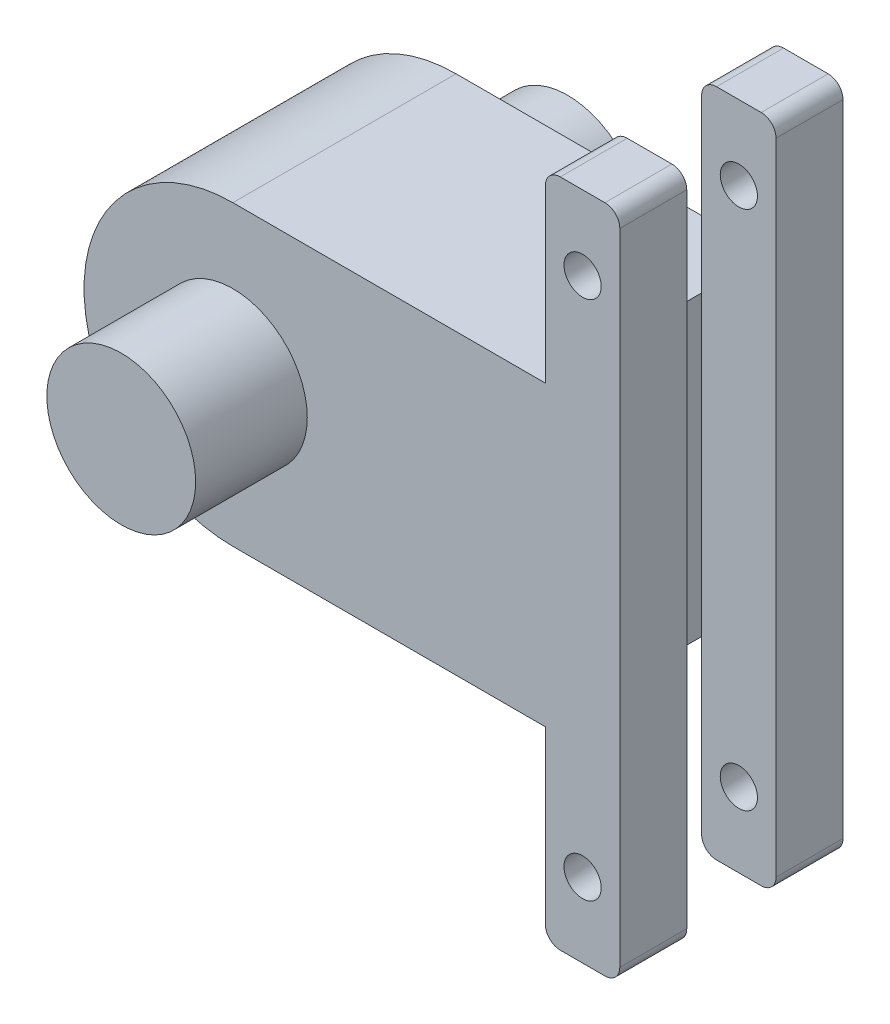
ISO-10303-21;
HEADER;
FILE_DESCRIPTION(('STEP AP214'),'2;1');
FILE_NAME('part.step','',(''),(''),'','','');
FILE_SCHEMA(('AUTOMOTIVE_DESIGN { 1 0 10303 214 1 1 1 1 }'));
ENDSEC;
DATA;
#1=APPLICATION_CONTEXT('core data for automotive mechanical design processes');
#2=APPLICATION_PROTOCOL_DEFINITION('international standard','automotive_design',2000,#1);
#3=PRODUCT_CONTEXT('',#1,'mechanical');
#4=PRODUCT('Part','Part','',(#3));
#5=PRODUCT_RELATED_PRODUCT_CATEGORY('part','',(#4));
#6=PRODUCT_DEFINITION_FORMATION('','',#4);
#7=PRODUCT_DEFINITION_CONTEXT('part definition',#1,'design');
#8=PRODUCT_DEFINITION('design','',#6,#7);
#9=PRODUCT_DEFINITION_SHAPE('','',#8);
#10=(LENGTH_UNIT() NAMED_UNIT(*) SI_UNIT(.MILLI.,.METRE.));
#11=(NAMED_UNIT(*) PLANE_ANGLE_UNIT() SI_UNIT($,.RADIAN.));
#12=(NAMED_UNIT(*) SI_UNIT($,.STERADIAN.) SOLID_ANGLE_UNIT());
#13=UNCERTAINTY_MEASURE_WITH_UNIT(LENGTH_MEASURE(1.E-05),#10,'distance_accuracy_value','');
#14=(GEOMETRIC_REPRESENTATION_CONTEXT(3) GLOBAL_UNCERTAINTY_ASSIGNED_CONTEXT((#13)) GLOBAL_UNIT_ASSIGNED_CONTEXT((#10,
#11,#12)) REPRESENTATION_CONTEXT('',''));
#15=CARTESIAN_POINT('',(0.,0.,0.));
#16=DIRECTION('',(0.,0.,1.));
#17=DIRECTION('',(1.,0.,0.));
#18=AXIS2_PLACEMENT_3D('',#15,#16,#17);
#19=CARTESIAN_POINT('',(0.,-45.,30.));
#20=DIRECTION('',(1.,0.,0.));
#21=DIRECTION('',(0.,1.,0.));
#22=AXIS2_PLACEMENT_3D('',#19,#20,#21);
#23=PLANE('',#22);
#24=DIRECTION('',(0.,-1.,0.));
#25=VECTOR('',#24,1.);
#26=CARTESIAN_POINT('',(0.,-45.,0.));
#27=LINE('',#26,#25);
#28=CARTESIAN_POINT('',(0.,-20.,0.));
#29=VERTEX_POINT('',#28);
#30=CARTESIAN_POINT('',(0.,-43.,0.));
#31=VERTEX_POINT('',#30);
#32=EDGE_CURVE('E269',#29,#31,#27,.T.);
#33=ORIENTED_EDGE('',*,*,#32,.T.);
#34=DIRECTION('',(0.,0.,-1.));
#35=VECTOR('',#34,1.);
#36=CARTESIAN_POINT('',(0.,-43.,30.));
#37=LINE('',#36,#35);
#38=CARTESIAN_POINT('',(0.,-43.,9.));
#39=VERTEX_POINT('',#38);
#40=EDGE_CURVE('E432',#31,#39,#37,.F.);
#41=ORIENTED_EDGE('',*,*,#40,.T.);
#42=DIRECTION('',(0.,-1.,0.));
#43=VECTOR('',#42,1.);
#44=CARTESIAN_POINT('',(0.,45.,9.));
#45=LINE('',#44,#43);
#46=CARTESIAN_POINT('',(0.,-20.,9.));
#47=VERTEX_POINT('',#46);
#48=EDGE_CURVE('E205',#47,#39,#45,.T.);
#49=ORIENTED_EDGE('',*,*,#48,.F.);
#50=DIRECTION('',(0.,0.,-1.));
#51=VECTOR('',#50,1.);
#52=CARTESIAN_POINT('',(0.,-20.,30.));
#53=LINE('',#52,#51);
#54=EDGE_CURVE('E232',#47,#29,#53,.T.);
#55=ORIENTED_EDGE('',*,*,#54,.T.);
#56=EDGE_LOOP('',(#33,#41,#49,#55));
#57=FACE_BOUND('',#56,.T.);
#58=ADVANCED_FACE('F43',(#57),#23,.F.);
#59=CARTESIAN_POINT('',(10.,-45.,30.));
#60=DIRECTION('',(0.,1.,0.));
#61=DIRECTION('',(0.,0.,1.));
#62=AXIS2_PLACEMENT_3D('',#59,#60,#61);
#63=PLANE('',#62);
#64=DIRECTION('',(1.,0.,0.));
#65=VECTOR('',#64,1.);
#66=CARTESIAN_POINT('',(10.,-45.,0.));
#67=LINE('',#66,#65);
#68=CARTESIAN_POINT('',(2.,-45.,0.));
#69=VERTEX_POINT('',#68);
#70=CARTESIAN_POINT('',(8.,-45.,0.));
#71=VERTEX_POINT('',#70);
#72=EDGE_CURVE('E265',#69,#71,#67,.T.);
#73=ORIENTED_EDGE('',*,*,#72,.T.);
#74=DIRECTION('',(0.,0.,-1.));
#75=VECTOR('',#74,1.);
#76=CARTESIAN_POINT('',(8.,-45.,30.));
#77=LINE('',#76,#75);
#78=CARTESIAN_POINT('',(8.,-45.,9.));
#79=VERTEX_POINT('',#78);
#80=EDGE_CURVE('E447',#71,#79,#77,.F.);
#81=ORIENTED_EDGE('',*,*,#80,.T.);
#82=DIRECTION('',(1.,0.,0.));
#83=VECTOR('',#82,1.);
#84=CARTESIAN_POINT('',(0.,-45.,9.));
#85=LINE('',#84,#83);
#86=CARTESIAN_POINT('',(2.,-45.,9.));
#87=VERTEX_POINT('',#86);
#88=EDGE_CURVE('E360',#87,#79,#85,.T.);
#89=ORIENTED_EDGE('',*,*,#88,.F.);
#90=DIRECTION('',(0.,0.,-1.));
#91=VECTOR('',#90,1.);
#92=CARTESIAN_POINT('',(2.,-45.,30.));
#93=LINE('',#92,#91);
#94=EDGE_CURVE('E450',#87,#69,#93,.T.);
#95=ORIENTED_EDGE('',*,*,#94,.T.);
#96=EDGE_LOOP('',(#73,#81,#89,#95));
#97=FACE_BOUND('',#96,.T.);
#98=ADVANCED_FACE('F510',(#97),#63,.F.);
#99=CARTESIAN_POINT('',(9.99999999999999,45.,30.));
#100=DIRECTION('',(-1.,0.,0.));
#101=DIRECTION('',(0.,-1.,0.));
#102=AXIS2_PLACEMENT_3D('',#99,#100,#101);
#103=PLANE('',#102);
#104=DIRECTION('',(0.,-1.,0.));
#105=VECTOR('',#104,1.);
#106=CARTESIAN_POINT('',(10.,45.,9.));
#107=LINE('',#106,#105);
#108=CARTESIAN_POINT('',(10.,43.,9.));
#109=VERTEX_POINT('',#108);
#110=CARTESIAN_POINT('',(10.,-43.,9.));
#111=VERTEX_POINT('',#110);
#112=EDGE_CURVE('E356',#109,#111,#107,.T.);
#113=ORIENTED_EDGE('',*,*,#112,.T.);
#114=DIRECTION('',(0.,0.,-1.));
#115=VECTOR('',#114,1.);
#116=CARTESIAN_POINT('',(10.,-43.,30.));
#117=LINE('',#116,#115);
#118=CARTESIAN_POINT('',(10.,-43.,0.));
#119=VERTEX_POINT('',#118);
#120=EDGE_CURVE('E466',#111,#119,#117,.T.);
#121=ORIENTED_EDGE('',*,*,#120,.T.);
#122=DIRECTION('',(0.,1.,0.));
#123=VECTOR('',#122,1.);
#124=CARTESIAN_POINT('',(9.99999999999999,45.,0.));
#125=LINE('',#124,#123);
#126=CARTESIAN_POINT('',(9.99999999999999,43.,0.));
#127=VERTEX_POINT('',#126);
#128=EDGE_CURVE('E261',#119,#127,#125,.T.);
#129=ORIENTED_EDGE('',*,*,#128,.T.);
#130=DIRECTION('',(0.,0.,-1.));
#131=VECTOR('',#130,1.);
#132=CARTESIAN_POINT('',(9.99999999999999,43.,30.));
#133=LINE('',#132,#131);
#134=EDGE_CURVE('E470',#127,#109,#133,.F.);
#135=ORIENTED_EDGE('',*,*,#134,.T.);
#136=EDGE_LOOP('',(#113,#121,#129,#135));
#137=FACE_BOUND('',#136,.T.);
#138=ADVANCED_FACE('F519',(#137),#103,.F.);
#139=CARTESIAN_POINT('',(0.,45.,30.));
#140=DIRECTION('',(0.,-1.,0.));
#141=DIRECTION('',(0.,0.,-1.));
#142=AXIS2_PLACEMENT_3D('',#139,#140,#141);
#143=PLANE('',#142);
#144=DIRECTION('',(-1.,0.,0.));
#145=VECTOR('',#144,1.);
#146=CARTESIAN_POINT('',(0.,45.,0.));
#147=LINE('',#146,#145);
#148=CARTESIAN_POINT('',(7.99999999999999,45.,0.));
#149=VERTEX_POINT('',#148);
#150=CARTESIAN_POINT('',(1.99999999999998,45.,0.));
#151=VERTEX_POINT('',#150);
#152=EDGE_CURVE('E257',#149,#151,#147,.T.);
#153=ORIENTED_EDGE('',*,*,#152,.T.);
#154=DIRECTION('',(0.,0.,-1.));
#155=VECTOR('',#154,1.);
#156=CARTESIAN_POINT('',(1.99999999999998,45.,30.));
#157=LINE('',#156,#155);
#158=CARTESIAN_POINT('',(1.99999999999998,45.,9.));
#159=VERTEX_POINT('',#158);
#160=EDGE_CURVE('E379',#151,#159,#157,.F.);
#161=ORIENTED_EDGE('',*,*,#160,.T.);
#162=DIRECTION('',(1.,0.,0.));
#163=VECTOR('',#162,1.);
#164=CARTESIAN_POINT('',(0.,45.,9.));
#165=LINE('',#164,#163);
#166=CARTESIAN_POINT('',(7.99999999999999,45.,9.));
#167=VERTEX_POINT('',#166);
#168=EDGE_CURVE('E351',#159,#167,#165,.T.);
#169=ORIENTED_EDGE('',*,*,#168,.T.);
#170=DIRECTION('',(0.,0.,-1.));
#171=VECTOR('',#170,1.);
#172=CARTESIAN_POINT('',(7.99999999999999,45.,30.));
#173=LINE('',#172,#171);
#174=EDGE_CURVE('E383',#167,#149,#173,.T.);
#175=ORIENTED_EDGE('',*,*,#174,.T.);
#176=EDGE_LOOP('',(#153,#161,#169,#175));
#177=FACE_BOUND('',#176,.T.);
#178=ADVANCED_FACE('F528',(#177),#143,.F.);
#179=CARTESIAN_POINT('',(0.,20.,30.));
#180=DIRECTION('',(1.,0.,0.));
#181=DIRECTION('',(0.,1.,0.));
#182=AXIS2_PLACEMENT_3D('',#179,#180,#181);
#183=PLANE('',#182);
#184=CARTESIAN_POINT('',(0.,43.,9.));
#185=VERTEX_POINT('',#184);
#186=CARTESIAN_POINT('',(0.,20.,9.));
#187=VERTEX_POINT('',#186);
#188=EDGE_CURVE('E353',#185,#187,#45,.T.);
#189=ORIENTED_EDGE('',*,*,#188,.F.);
#190=DIRECTION('',(0.,0.,-1.));
#191=VECTOR('',#190,1.);
#192=CARTESIAN_POINT('',(0.,43.,30.));
#193=LINE('',#192,#191);
#194=CARTESIAN_POINT('',(0.,43.,0.));
#195=VERTEX_POINT('',#194);
#196=EDGE_CURVE('E389',#185,#195,#193,.T.);
#197=ORIENTED_EDGE('',*,*,#196,.T.);
#198=DIRECTION('',(0.,-1.,0.));
#199=VECTOR('',#198,1.);
#200=CARTESIAN_POINT('',(0.,20.,0.));
#201=LINE('',#200,#199);
#202=CARTESIAN_POINT('',(0.,20.,0.));
#203=VERTEX_POINT('',#202);
#204=EDGE_CURVE('E254',#195,#203,#201,.T.);
#205=ORIENTED_EDGE('',*,*,#204,.T.);
#206=DIRECTION('',(0.,0.,-1.));
#207=VECTOR('',#206,1.);
#208=CARTESIAN_POINT('',(0.,20.,30.));
#209=LINE('',#208,#207);
#210=EDGE_CURVE('E222',#187,#203,#209,.T.);
#211=ORIENTED_EDGE('',*,*,#210,.F.);
#212=EDGE_LOOP('',(#189,#197,#205,#211));
#213=FACE_BOUND('',#212,.T.);
#214=ADVANCED_FACE('F535',(#213),#183,.F.);
#215=CARTESIAN_POINT('',(4.99999999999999,35.,30.));
#216=DIRECTION('',(0.,0.,-1.));
#217=DIRECTION('',(-1.,0.,0.));
#218=AXIS2_PLACEMENT_3D('',#215,#216,#217);
#219=CYLINDRICAL_SURFACE('',#218,2.5);
#220=CARTESIAN_POINT('',(4.99999999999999,35.,9.));
#221=DIRECTION('',(0.,0.,-1.));
#222=DIRECTION('',(-1.,0.,0.));
#223=AXIS2_PLACEMENT_3D('',#220,#221,#222);
#224=CIRCLE('',#223,2.5);
#225=CARTESIAN_POINT('',(2.49999999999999,35.,9.));
#226=VERTEX_POINT('',#225);
#227=EDGE_CURVE('E338',#226,#226,#224,.T.);
#228=ORIENTED_EDGE('',*,*,#227,.F.);
#229=EDGE_LOOP('',(#228));
#230=FACE_BOUND('',#229,.T.);
#231=CARTESIAN_POINT('',(4.99999999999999,35.,0.));
#232=DIRECTION('',(0.,0.,1.));
#233=DIRECTION('',(1.,0.,0.));
#234=AXIS2_PLACEMENT_3D('',#231,#232,#233);
#235=CIRCLE('',#234,2.5);
#236=CARTESIAN_POINT('',(7.49999999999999,35.,0.));
#237=VERTEX_POINT('',#236);
#238=EDGE_CURVE('E304',#237,#237,#235,.T.);
#239=ORIENTED_EDGE('',*,*,#238,.F.);
#240=EDGE_LOOP('',(#239));
#241=FACE_BOUND('',#240,.T.);
#242=ADVANCED_FACE('F716',(#230,#241),#219,.F.);
#243=CARTESIAN_POINT('',(4.99999999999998,-35.,30.));
#244=DIRECTION('',(0.,0.,-1.));
#245=DIRECTION('',(-1.,0.,0.));
#246=AXIS2_PLACEMENT_3D('',#243,#244,#245);
#247=CYLINDRICAL_SURFACE('',#246,2.5);
#248=CARTESIAN_POINT('',(4.99999999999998,-35.,9.));
#249=DIRECTION('',(0.,0.,-1.));
#250=DIRECTION('',(-1.,0.,0.));
#251=AXIS2_PLACEMENT_3D('',#248,#249,#250);
#252=CIRCLE('',#251,2.5);
#253=CARTESIAN_POINT('',(2.49999999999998,-35.,9.));
#254=VERTEX_POINT('',#253);
#255=EDGE_CURVE('E342',#254,#254,#252,.T.);
#256=ORIENTED_EDGE('',*,*,#255,.F.);
#257=EDGE_LOOP('',(#256));
#258=FACE_BOUND('',#257,.T.);
#259=CARTESIAN_POINT('',(4.99999999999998,-35.,0.));
#260=DIRECTION('',(0.,0.,1.));
#261=DIRECTION('',(-1.,0.,0.));
#262=AXIS2_PLACEMENT_3D('',#259,#260,#261);
#263=CIRCLE('',#262,2.5);
#264=CARTESIAN_POINT('',(2.49999999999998,-35.,0.));
#265=VERTEX_POINT('',#264);
#266=EDGE_CURVE('E312',#265,#265,#263,.T.);
#267=ORIENTED_EDGE('',*,*,#266,.F.);
#268=EDGE_LOOP('',(#267));
#269=FACE_BOUND('',#268,.T.);
#270=ADVANCED_FACE('F727',(#258,#269),#247,.F.);
#271=CARTESIAN_POINT('',(-42.,0.,30.));
#272=DIRECTION('',(0.,0.,1.));
#273=DIRECTION('',(1.,0.,0.));
#274=AXIS2_PLACEMENT_3D('',#271,#272,#273);
#275=PLANE('',#274);
#276=CARTESIAN_POINT('',(-42.,0.,30.));
#277=DIRECTION('',(0.,0.,1.));
#278=DIRECTION('',(1.,0.,0.));
#279=AXIS2_PLACEMENT_3D('',#276,#277,#278);
#280=CIRCLE('',#279,10.);
#281=CARTESIAN_POINT('',(-32.,0.,30.));
#282=VERTEX_POINT('',#281);
#283=EDGE_CURVE('E320',#282,#282,#280,.T.);
#284=ORIENTED_EDGE('',*,*,#283,.F.);
#285=EDGE_LOOP('',(#284));
#286=FACE_BOUND('',#285,.T.);
#287=CARTESIAN_POINT('',(4.99999999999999,35.,30.));
#288=DIRECTION('',(0.,0.,1.));
#289=DIRECTION('',(1.,0.,0.));
#290=AXIS2_PLACEMENT_3D('',#287,#288,#289);
#291=CIRCLE('',#290,2.5);
#292=CARTESIAN_POINT('',(7.49999999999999,35.,30.));
#293=VERTEX_POINT('',#292);
#294=EDGE_CURVE('E279',#293,#293,#291,.T.);
#295=ORIENTED_EDGE('',*,*,#294,.F.);
#296=EDGE_LOOP('',(#295));
#297=FACE_BOUND('',#296,.T.);
#298=DIRECTION('',(0.,-1.,0.));
#299=VECTOR('',#298,1.);
#300=CARTESIAN_POINT('',(0.,-45.,30.));
#301=LINE('',#300,#299);
#302=CARTESIAN_POINT('',(0.,-20.,30.));
#303=VERTEX_POINT('',#302);
#304=CARTESIAN_POINT('',(0.,-43.,30.));
#305=VERTEX_POINT('',#304);
#306=EDGE_CURVE('E294',#303,#305,#301,.T.);
#307=ORIENTED_EDGE('',*,*,#306,.T.);
#308=CARTESIAN_POINT('',(2.,-43.,30.));
#309=DIRECTION('',(0.,0.,1.));
#310=DIRECTION('',(1.,0.,0.));
#311=AXIS2_PLACEMENT_3D('',#308,#309,#310);
#312=CIRCLE('',#311,2.);
#313=CARTESIAN_POINT('',(2.,-45.,30.));
#314=VERTEX_POINT('',#313);
#315=EDGE_CURVE('E400',#305,#314,#312,.T.);
#316=ORIENTED_EDGE('',*,*,#315,.T.);
#317=DIRECTION('',(1.,0.,0.));
#318=VECTOR('',#317,1.);
#319=CARTESIAN_POINT('',(10.,-45.,30.));
#320=LINE('',#319,#318);
#321=CARTESIAN_POINT('',(8.,-45.,30.));
#322=VERTEX_POINT('',#321);
#323=EDGE_CURVE('E290',#314,#322,#320,.T.);
#324=ORIENTED_EDGE('',*,*,#323,.T.);
#325=CARTESIAN_POINT('',(8.,-43.,30.));
#326=DIRECTION('',(0.,0.,1.));
#327=DIRECTION('',(1.,0.,0.));
#328=AXIS2_PLACEMENT_3D('',#325,#326,#327);
#329=CIRCLE('',#328,2.);
#330=CARTESIAN_POINT('',(10.,-43.,30.));
#331=VERTEX_POINT('',#330);
#332=EDGE_CURVE('E403',#322,#331,#329,.T.);
#333=ORIENTED_EDGE('',*,*,#332,.T.);
#334=DIRECTION('',(0.,1.,0.));
#335=VECTOR('',#334,1.);
#336=CARTESIAN_POINT('',(9.99999999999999,45.,30.));
#337=LINE('',#336,#335);
#338=CARTESIAN_POINT('',(9.99999999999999,43.,30.));
#339=VERTEX_POINT('',#338);
#340=EDGE_CURVE('E286',#331,#339,#337,.T.);
#341=ORIENTED_EDGE('',*,*,#340,.T.);
#342=CARTESIAN_POINT('',(7.99999999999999,43.,30.));
#343=DIRECTION('',(0.,0.,1.));
#344=DIRECTION('',(1.,0.,0.));
#345=AXIS2_PLACEMENT_3D('',#342,#343,#344);
#346=CIRCLE('',#345,2.);
#347=CARTESIAN_POINT('',(7.99999999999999,45.,30.));
#348=VERTEX_POINT('',#347);
#349=EDGE_CURVE('E406',#339,#348,#346,.T.);
#350=ORIENTED_EDGE('',*,*,#349,.T.);
#351=DIRECTION('',(-1.,0.,0.));
#352=VECTOR('',#351,1.);
#353=CARTESIAN_POINT('',(0.,45.,30.));
#354=LINE('',#353,#352);
#355=CARTESIAN_POINT('',(1.99999999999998,45.,30.));
#356=VERTEX_POINT('',#355);
#357=EDGE_CURVE('E283',#348,#356,#354,.T.);
#358=ORIENTED_EDGE('',*,*,#357,.T.);
#359=CARTESIAN_POINT('',(1.99999999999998,43.,30.));
#360=DIRECTION('',(0.,0.,1.));
#361=DIRECTION('',(1.,0.,0.));
#362=AXIS2_PLACEMENT_3D('',#359,#360,#361);
#363=CIRCLE('',#362,2.);
#364=CARTESIAN_POINT('',(0.,43.,30.));
#365=VERTEX_POINT('',#364);
#366=EDGE_CURVE('E59',#356,#365,#363,.T.);
#367=ORIENTED_EDGE('',*,*,#366,.T.);
#368=DIRECTION('',(0.,-1.,0.));
#369=VECTOR('',#368,1.);
#370=CARTESIAN_POINT('',(0.,20.,30.));
#371=LINE('',#370,#369);
#372=CARTESIAN_POINT('',(0.,20.,30.));
#373=VERTEX_POINT('',#372);
#374=EDGE_CURVE('E247',#365,#373,#371,.T.);
#375=ORIENTED_EDGE('',*,*,#374,.T.);
#376=DIRECTION('',(-1.,0.,0.));
#377=VECTOR('',#376,1.);
#378=CARTESIAN_POINT('',(-42.,20.,30.));
#379=LINE('',#378,#377);
#380=CARTESIAN_POINT('',(-42.,20.,30.));
#381=VERTEX_POINT('',#380);
#382=EDGE_CURVE('E230',#373,#381,#379,.T.);
#383=ORIENTED_EDGE('',*,*,#382,.T.);
#384=CARTESIAN_POINT('',(-42.,0.,30.));
#385=DIRECTION('',(0.,0.,1.));
#386=DIRECTION('',(1.,0.,0.));
#387=AXIS2_PLACEMENT_3D('',#384,#385,#386);
#388=CIRCLE('',#387,20.);
#389=CARTESIAN_POINT('',(-42.,-20.,30.));
#390=VERTEX_POINT('',#389);
#391=EDGE_CURVE('E253',#381,#390,#388,.T.);
#392=ORIENTED_EDGE('',*,*,#391,.T.);
#393=DIRECTION('',(1.,0.,0.));
#394=VECTOR('',#393,1.);
#395=CARTESIAN_POINT('',(-42.,-20.,30.));
#396=LINE('',#395,#394);
#397=EDGE_CURVE('E298',#390,#303,#396,.T.);
#398=ORIENTED_EDGE('',*,*,#397,.T.);
#399=EDGE_LOOP('',(#307,#316,#324,#333,#341,#350,#358,#367,#375,#383,#392,#398));
#400=FACE_BOUND('',#399,.T.);
#401=CARTESIAN_POINT('',(4.99999999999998,-35.,30.));
#402=DIRECTION('',(0.,0.,1.));
#403=DIRECTION('',(-1.,0.,0.));
#404=AXIS2_PLACEMENT_3D('',#401,#402,#403);
#405=CIRCLE('',#404,2.5);
#406=CARTESIAN_POINT('',(2.49999999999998,-35.,30.));
#407=VERTEX_POINT('',#406);
#408=EDGE_CURVE('E308',#407,#407,#405,.T.);
#409=ORIENTED_EDGE('',*,*,#408,.F.);
#410=EDGE_LOOP('',(#409));
#411=FACE_BOUND('',#410,.T.);
#412=ADVANCED_FACE('F542',(#286,#297,#400,#411),#275,.T.);
#413=CARTESIAN_POINT('',(-42.,0.,0.));
#414=DIRECTION('',(0.,0.,1.));
#415=DIRECTION('',(1.,0.,0.));
#416=AXIS2_PLACEMENT_3D('',#413,#414,#415);
#417=PLANE('',#416);
#418=CARTESIAN_POINT('',(-42.,0.,0.));
#419=DIRECTION('',(0.,0.,1.));
#420=DIRECTION('',(1.,0.,0.));
#421=AXIS2_PLACEMENT_3D('',#418,#419,#420);
#422=CIRCLE('',#421,10.);
#423=CARTESIAN_POINT('',(-32.,0.,0.));
#424=VERTEX_POINT('',#423);
#425=EDGE_CURVE('E328',#424,#424,#422,.T.);
#426=ORIENTED_EDGE('',*,*,#425,.T.);
#427=EDGE_LOOP('',(#426));
#428=FACE_BOUND('',#427,.T.);
#429=ORIENTED_EDGE('',*,*,#128,.F.);
#430=CARTESIAN_POINT('',(8.,-43.,0.));
#431=DIRECTION('',(0.,0.,1.));
#432=DIRECTION('',(1.,0.,0.));
#433=AXIS2_PLACEMENT_3D('',#430,#431,#432);
#434=CIRCLE('',#433,2.);
#435=EDGE_CURVE('E454',#119,#71,#434,.F.);
#436=ORIENTED_EDGE('',*,*,#435,.T.);
#437=ORIENTED_EDGE('',*,*,#72,.F.);
#438=CARTESIAN_POINT('',(2.,-43.,0.));
#439=DIRECTION('',(0.,0.,1.));
#440=DIRECTION('',(1.,0.,0.));
#441=AXIS2_PLACEMENT_3D('',#438,#439,#440);
#442=CIRCLE('',#441,2.);
#443=EDGE_CURVE('E457',#69,#31,#442,.F.);
#444=ORIENTED_EDGE('',*,*,#443,.T.);
#445=ORIENTED_EDGE('',*,*,#32,.F.);
#446=DIRECTION('',(1.,0.,0.));
#447=VECTOR('',#446,1.);
#448=CARTESIAN_POINT('',(-42.,-20.,0.));
#449=LINE('',#448,#447);
#450=CARTESIAN_POINT('',(-42.,-20.,0.));
#451=VERTEX_POINT('',#450);
#452=EDGE_CURVE('E273',#451,#29,#449,.T.);
#453=ORIENTED_EDGE('',*,*,#452,.F.);
#454=CARTESIAN_POINT('',(-42.,0.,0.));
#455=DIRECTION('',(0.,0.,1.));
#456=DIRECTION('',(1.,0.,0.));
#457=AXIS2_PLACEMENT_3D('',#454,#455,#456);
#458=CIRCLE('',#457,20.);
#459=CARTESIAN_POINT('',(-42.,20.,0.));
#460=VERTEX_POINT('',#459);
#461=EDGE_CURVE('E277',#460,#451,#458,.T.);
#462=ORIENTED_EDGE('',*,*,#461,.F.);
#463=DIRECTION('',(-1.,0.,0.));
#464=VECTOR('',#463,1.);
#465=CARTESIAN_POINT('',(-42.,20.,0.));
#466=LINE('',#465,#464);
#467=EDGE_CURVE('E250',#203,#460,#466,.T.);
#468=ORIENTED_EDGE('',*,*,#467,.F.);
#469=ORIENTED_EDGE('',*,*,#204,.F.);
#470=CARTESIAN_POINT('',(1.99999999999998,43.,0.));
#471=DIRECTION('',(0.,0.,1.));
#472=DIRECTION('',(1.,0.,0.));
#473=AXIS2_PLACEMENT_3D('',#470,#471,#472);
#474=CIRCLE('',#473,2.);
#475=EDGE_CURVE('E460',#195,#151,#474,.F.);
#476=ORIENTED_EDGE('',*,*,#475,.T.);
#477=ORIENTED_EDGE('',*,*,#152,.F.);
#478=CARTESIAN_POINT('',(7.99999999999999,43.,0.));
#479=DIRECTION('',(0.,0.,1.));
#480=DIRECTION('',(1.,0.,0.));
#481=AXIS2_PLACEMENT_3D('',#478,#479,#480);
#482=CIRCLE('',#481,2.);
#483=EDGE_CURVE('E463',#149,#127,#482,.F.);
#484=ORIENTED_EDGE('',*,*,#483,.T.);
#485=EDGE_LOOP('',(#429,#436,#437,#444,#445,#453,#462,#468,#469,#476,#477,#484));
#486=FACE_BOUND('',#485,.T.);
#487=ORIENTED_EDGE('',*,*,#238,.T.);
#488=EDGE_LOOP('',(#487));
#489=FACE_BOUND('',#488,.T.);
#490=ORIENTED_EDGE('',*,*,#266,.T.);
#491=EDGE_LOOP('',(#490));
#492=FACE_BOUND('',#491,.T.);
#493=ADVANCED_FACE('F538',(#428,#486,#489,#492),#417,.F.);
#494=CARTESIAN_POINT('',(-42.,0.,30.));
#495=DIRECTION('',(0.,0.,-1.));
#496=DIRECTION('',(-1.,0.,0.));
#497=AXIS2_PLACEMENT_3D('',#494,#495,#496);
#498=CYLINDRICAL_SURFACE('',#497,20.);
#499=ORIENTED_EDGE('',*,*,#461,.T.);
#500=DIRECTION('',(0.,0.,-1.));
#501=VECTOR('',#500,1.);
#502=CARTESIAN_POINT('',(-42.,-20.,30.));
#503=LINE('',#502,#501);
#504=EDGE_CURVE('E473',#390,#451,#503,.T.);
#505=ORIENTED_EDGE('',*,*,#504,.F.);
#506=ORIENTED_EDGE('',*,*,#391,.F.);
#507=DIRECTION('',(0.,0.,-1.));
#508=VECTOR('',#507,1.);
#509=CARTESIAN_POINT('',(-42.,20.,30.));
#510=LINE('',#509,#508);
#511=EDGE_CURVE('E238',#381,#460,#510,.T.);
#512=ORIENTED_EDGE('',*,*,#511,.T.);
#513=EDGE_LOOP('',(#499,#505,#506,#512));
#514=FACE_BOUND('',#513,.T.);
#515=ADVANCED_FACE('F541',(#514),#498,.T.);
#516=CARTESIAN_POINT('',(-42.,-20.,30.));
#517=DIRECTION('',(0.,1.,0.));
#518=DIRECTION('',(-1.,0.,0.));
#519=AXIS2_PLACEMENT_3D('',#516,#517,#518);
#520=PLANE('',#519);
#521=ORIENTED_EDGE('',*,*,#452,.T.);
#522=ORIENTED_EDGE('',*,*,#54,.F.);
#523=DIRECTION('',(0.,0.,1.));
#524=VECTOR('',#523,1.);
#525=CARTESIAN_POINT('',(0.,-20.,30.));
#526=LINE('',#525,#524);
#527=CARTESIAN_POINT('',(0.,-20.,21.));
#528=VERTEX_POINT('',#527);
#529=EDGE_CURVE('E332',#47,#528,#526,.T.);
#530=ORIENTED_EDGE('',*,*,#529,.T.);
#531=EDGE_CURVE('E234',#303,#528,#53,.T.);
#532=ORIENTED_EDGE('',*,*,#531,.F.);
#533=ORIENTED_EDGE('',*,*,#397,.F.);
#534=ORIENTED_EDGE('',*,*,#504,.T.);
#535=EDGE_LOOP('',(#521,#522,#530,#532,#533,#534));
#536=FACE_BOUND('',#535,.T.);
#537=ADVANCED_FACE('F490',(#536),#520,.F.);
#538=DIRECTION('',(0.,-1.,0.));
#539=VECTOR('',#538,1.);
#540=CARTESIAN_POINT('',(0.,45.,21.));
#541=LINE('',#540,#539);
#542=CARTESIAN_POINT('',(0.,-43.,21.));
#543=VERTEX_POINT('',#542);
#544=EDGE_CURVE('E208',#528,#543,#541,.T.);
#545=ORIENTED_EDGE('',*,*,#544,.T.);
#546=DIRECTION('',(0.,0.,-1.));
#547=VECTOR('',#546,1.);
#548=CARTESIAN_POINT('',(0.,-43.,30.));
#549=LINE('',#548,#547);
#550=EDGE_CURVE('E411',#543,#305,#549,.F.);
#551=ORIENTED_EDGE('',*,*,#550,.T.);
#552=ORIENTED_EDGE('',*,*,#306,.F.);
#553=ORIENTED_EDGE('',*,*,#531,.T.);
#554=EDGE_LOOP('',(#545,#551,#552,#553));
#555=FACE_BOUND('',#554,.T.);
#556=ADVANCED_FACE('F487',(#555),#23,.F.);
#557=ORIENTED_EDGE('',*,*,#323,.F.);
#558=DIRECTION('',(0.,0.,-1.));
#559=VECTOR('',#558,1.);
#560=CARTESIAN_POINT('',(2.,-45.,30.));
#561=LINE('',#560,#559);
#562=CARTESIAN_POINT('',(2.,-45.,21.));
#563=VERTEX_POINT('',#562);
#564=EDGE_CURVE('E425',#314,#563,#561,.T.);
#565=ORIENTED_EDGE('',*,*,#564,.T.);
#566=DIRECTION('',(-1.,0.,0.));
#567=VECTOR('',#566,1.);
#568=CARTESIAN_POINT('',(0.,-45.,21.));
#569=LINE('',#568,#567);
#570=CARTESIAN_POINT('',(8.,-45.,21.));
#571=VERTEX_POINT('',#570);
#572=EDGE_CURVE('E365',#571,#563,#569,.T.);
#573=ORIENTED_EDGE('',*,*,#572,.F.);
#574=DIRECTION('',(0.,0.,-1.));
#575=VECTOR('',#574,1.);
#576=CARTESIAN_POINT('',(8.,-45.,30.));
#577=LINE('',#576,#575);
#578=EDGE_CURVE('E429',#571,#322,#577,.F.);
#579=ORIENTED_EDGE('',*,*,#578,.T.);
#580=EDGE_LOOP('',(#557,#565,#573,#579));
#581=FACE_BOUND('',#580,.T.);
#582=ADVANCED_FACE('F551',(#581),#63,.F.);
#583=ORIENTED_EDGE('',*,*,#340,.F.);
#584=DIRECTION('',(0.,0.,-1.));
#585=VECTOR('',#584,1.);
#586=CARTESIAN_POINT('',(10.,-43.,30.));
#587=LINE('',#586,#585);
#588=CARTESIAN_POINT('',(10.,-43.,21.));
#589=VERTEX_POINT('',#588);
#590=EDGE_CURVE('E393',#331,#589,#587,.T.);
#591=ORIENTED_EDGE('',*,*,#590,.T.);
#592=DIRECTION('',(0.,-1.,0.));
#593=VECTOR('',#592,1.);
#594=CARTESIAN_POINT('',(10.,45.,21.));
#595=LINE('',#594,#593);
#596=CARTESIAN_POINT('',(10.,43.,21.));
#597=VERTEX_POINT('',#596);
#598=EDGE_CURVE('E348',#597,#589,#595,.T.);
#599=ORIENTED_EDGE('',*,*,#598,.F.);
#600=DIRECTION('',(0.,0.,-1.));
#601=VECTOR('',#600,1.);
#602=CARTESIAN_POINT('',(9.99999999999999,43.,30.));
#603=LINE('',#602,#601);
#604=EDGE_CURVE('E397',#597,#339,#603,.F.);
#605=ORIENTED_EDGE('',*,*,#604,.T.);
#606=EDGE_LOOP('',(#583,#591,#599,#605));
#607=FACE_BOUND('',#606,.T.);
#608=ADVANCED_FACE('F560',(#607),#103,.F.);
#609=ORIENTED_EDGE('',*,*,#357,.F.);
#610=DIRECTION('',(0.,0.,-1.));
#611=VECTOR('',#610,1.);
#612=CARTESIAN_POINT('',(7.99999999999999,45.,30.));
#613=LINE('',#612,#611);
#614=CARTESIAN_POINT('',(7.99999999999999,45.,21.));
#615=VERTEX_POINT('',#614);
#616=EDGE_CURVE('E52',#348,#615,#613,.T.);
#617=ORIENTED_EDGE('',*,*,#616,.T.);
#618=DIRECTION('',(-1.,0.,0.));
#619=VECTOR('',#618,1.);
#620=CARTESIAN_POINT('',(0.,45.,21.));
#621=LINE('',#620,#619);
#622=CARTESIAN_POINT('',(1.99999999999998,45.,21.));
#623=VERTEX_POINT('',#622);
#624=EDGE_CURVE('E364',#615,#623,#621,.T.);
#625=ORIENTED_EDGE('',*,*,#624,.T.);
#626=DIRECTION('',(0.,0.,-1.));
#627=VECTOR('',#626,1.);
#628=CARTESIAN_POINT('',(1.99999999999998,45.,30.));
#629=LINE('',#628,#627);
#630=EDGE_CURVE('E67',#623,#356,#629,.F.);
#631=ORIENTED_EDGE('',*,*,#630,.T.);
#632=EDGE_LOOP('',(#609,#617,#625,#631));
#633=FACE_BOUND('',#632,.T.);
#634=ADVANCED_FACE('F374',(#633),#143,.F.);
#635=ORIENTED_EDGE('',*,*,#374,.F.);
#636=DIRECTION('',(0.,0.,-1.));
#637=VECTOR('',#636,1.);
#638=CARTESIAN_POINT('',(0.,43.,30.));
#639=LINE('',#638,#637);
#640=CARTESIAN_POINT('',(0.,43.,21.));
#641=VERTEX_POINT('',#640);
#642=EDGE_CURVE('E11',#365,#641,#639,.T.);
#643=ORIENTED_EDGE('',*,*,#642,.T.);
#644=CARTESIAN_POINT('',(0.,20.,21.));
#645=VERTEX_POINT('',#644);
#646=EDGE_CURVE('E195',#641,#645,#541,.T.);
#647=ORIENTED_EDGE('',*,*,#646,.T.);
#648=EDGE_CURVE('E199',#373,#645,#209,.T.);
#649=ORIENTED_EDGE('',*,*,#648,.F.);
#650=EDGE_LOOP('',(#635,#643,#647,#649));
#651=FACE_BOUND('',#650,.T.);
#652=ADVANCED_FACE('F197',(#651),#183,.F.);
#653=CARTESIAN_POINT('',(-42.,20.,30.));
#654=DIRECTION('',(0.,-1.,0.));
#655=DIRECTION('',(1.,0.,0.));
#656=AXIS2_PLACEMENT_3D('',#653,#654,#655);
#657=PLANE('',#656);
#658=ORIENTED_EDGE('',*,*,#467,.T.);
#659=ORIENTED_EDGE('',*,*,#511,.F.);
#660=ORIENTED_EDGE('',*,*,#382,.F.);
#661=ORIENTED_EDGE('',*,*,#648,.T.);
#662=EDGE_CURVE('E213',#645,#187,#209,.T.);
#663=ORIENTED_EDGE('',*,*,#662,.T.);
#664=ORIENTED_EDGE('',*,*,#210,.T.);
#665=EDGE_LOOP('',(#658,#659,#660,#661,#663,#664));
#666=FACE_BOUND('',#665,.T.);
#667=ADVANCED_FACE('F228',(#666),#657,.F.);
#668=CARTESIAN_POINT('',(4.99999999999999,35.,21.));
#669=DIRECTION('',(0.,0.,1.));
#670=DIRECTION('',(1.,0.,0.));
#671=AXIS2_PLACEMENT_3D('',#668,#669,#670);
#672=CIRCLE('',#671,2.5);
#673=CARTESIAN_POINT('',(7.49999999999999,35.,21.));
#674=VERTEX_POINT('',#673);
#675=EDGE_CURVE('E343',#674,#674,#672,.T.);
#676=ORIENTED_EDGE('',*,*,#675,.F.);
#677=EDGE_LOOP('',(#676));
#678=FACE_BOUND('',#677,.T.);
#679=ORIENTED_EDGE('',*,*,#294,.T.);
#680=EDGE_LOOP('',(#679));
#681=FACE_BOUND('',#680,.T.);
#682=ADVANCED_FACE('F730',(#678,#681),#219,.F.);
#683=CARTESIAN_POINT('',(4.99999999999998,-35.,21.));
#684=DIRECTION('',(0.,0.,1.));
#685=DIRECTION('',(1.,0.,0.));
#686=AXIS2_PLACEMENT_3D('',#683,#684,#685);
#687=CIRCLE('',#686,2.5);
#688=CARTESIAN_POINT('',(7.49999999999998,-35.,21.));
#689=VERTEX_POINT('',#688);
#690=EDGE_CURVE('E347',#689,#689,#687,.T.);
#691=ORIENTED_EDGE('',*,*,#690,.F.);
#692=EDGE_LOOP('',(#691));
#693=FACE_BOUND('',#692,.T.);
#694=ORIENTED_EDGE('',*,*,#408,.T.);
#695=EDGE_LOOP('',(#694));
#696=FACE_BOUND('',#695,.T.);
#697=ADVANCED_FACE('F742',(#693,#696),#247,.F.);
#698=CARTESIAN_POINT('',(-42.,0.,45.));
#699=DIRECTION('',(0.,0.,-1.));
#700=DIRECTION('',(-1.,0.,0.));
#701=AXIS2_PLACEMENT_3D('',#698,#699,#700);
#702=CYLINDRICAL_SURFACE('',#701,10.);
#703=CARTESIAN_POINT('',(-42.,0.,45.));
#704=DIRECTION('',(0.,0.,1.));
#705=DIRECTION('',(1.,0.,0.));
#706=AXIS2_PLACEMENT_3D('',#703,#704,#705);
#707=CIRCLE('',#706,10.);
#708=CARTESIAN_POINT('',(-32.,0.,45.));
#709=VERTEX_POINT('',#708);
#710=EDGE_CURVE('E316',#709,#709,#707,.T.);
#711=ORIENTED_EDGE('',*,*,#710,.F.);
#712=EDGE_LOOP('',(#711));
#713=FACE_BOUND('',#712,.T.);
#714=ORIENTED_EDGE('',*,*,#283,.T.);
#715=EDGE_LOOP('',(#714));
#716=FACE_BOUND('',#715,.T.);
#717=ADVANCED_FACE('F769',(#713,#716),#702,.T.);
#718=CARTESIAN_POINT('',(-42.,0.,45.));
#719=DIRECTION('',(0.,0.,1.));
#720=DIRECTION('',(1.,0.,0.));
#721=AXIS2_PLACEMENT_3D('',#718,#719,#720);
#722=PLANE('',#721);
#723=ORIENTED_EDGE('',*,*,#710,.T.);
#724=EDGE_LOOP('',(#723));
#725=FACE_BOUND('',#724,.T.);
#726=ADVANCED_FACE('F759',(#725),#722,.T.);
#727=CARTESIAN_POINT('',(-42.,0.,-15.));
#728=DIRECTION('',(0.,0.,1.));
#729=DIRECTION('',(1.,0.,0.));
#730=AXIS2_PLACEMENT_3D('',#727,#728,#729);
#731=CYLINDRICAL_SURFACE('',#730,10.);
#732=CARTESIAN_POINT('',(-42.,0.,-15.));
#733=DIRECTION('',(0.,0.,1.));
#734=DIRECTION('',(1.,0.,0.));
#735=AXIS2_PLACEMENT_3D('',#732,#733,#734);
#736=CIRCLE('',#735,10.);
#737=CARTESIAN_POINT('',(-32.,0.,-15.));
#738=VERTEX_POINT('',#737);
#739=EDGE_CURVE('E324',#738,#738,#736,.T.);
#740=ORIENTED_EDGE('',*,*,#739,.T.);
#741=EDGE_LOOP('',(#740));
#742=FACE_BOUND('',#741,.T.);
#743=ORIENTED_EDGE('',*,*,#425,.F.);
#744=EDGE_LOOP('',(#743));
#745=FACE_BOUND('',#744,.T.);
#746=ADVANCED_FACE('F750',(#742,#745),#731,.T.);
#747=CARTESIAN_POINT('',(-42.,0.,-15.));
#748=DIRECTION('',(0.,0.,-1.));
#749=DIRECTION('',(1.,0.,0.));
#750=AXIS2_PLACEMENT_3D('',#747,#748,#749);
#751=PLANE('',#750);
#752=ORIENTED_EDGE('',*,*,#739,.F.);
#753=EDGE_LOOP('',(#752));
#754=FACE_BOUND('',#753,.T.);
#755=ADVANCED_FACE('F675',(#754),#751,.T.);
#756=CARTESIAN_POINT('',(0.,45.,9.));
#757=DIRECTION('',(-1.,0.,0.));
#758=DIRECTION('',(0.,0.,1.));
#759=AXIS2_PLACEMENT_3D('',#756,#757,#758);
#760=PLANE('',#759);
#761=EDGE_CURVE('E217',#187,#47,#45,.T.);
#762=ORIENTED_EDGE('',*,*,#761,.F.);
#763=ORIENTED_EDGE('',*,*,#662,.F.);
#764=EDGE_CURVE('E206',#645,#528,#541,.T.);
#765=ORIENTED_EDGE('',*,*,#764,.T.);
#766=ORIENTED_EDGE('',*,*,#529,.F.);
#767=EDGE_LOOP('',(#762,#763,#765,#766));
#768=FACE_BOUND('',#767,.T.);
#769=ADVANCED_FACE('F214',(#768),#760,.F.);
#770=CARTESIAN_POINT('',(0.,45.,9.));
#771=DIRECTION('',(0.,0.,-1.));
#772=DIRECTION('',(-1.,0.,0.));
#773=AXIS2_PLACEMENT_3D('',#770,#771,#772);
#774=PLANE('',#773);
#775=ORIENTED_EDGE('',*,*,#227,.T.);
#776=EDGE_LOOP('',(#775));
#777=FACE_BOUND('',#776,.T.);
#778=ORIENTED_EDGE('',*,*,#255,.T.);
#779=EDGE_LOOP('',(#778));
#780=FACE_BOUND('',#779,.T.);
#781=ORIENTED_EDGE('',*,*,#88,.T.);
#782=CARTESIAN_POINT('',(8.,-43.,9.));
#783=DIRECTION('',(0.,0.,-1.));
#784=DIRECTION('',(-1.,0.,0.));
#785=AXIS2_PLACEMENT_3D('',#782,#783,#784);
#786=CIRCLE('',#785,2.);
#787=EDGE_CURVE('E435',#79,#111,#786,.F.);
#788=ORIENTED_EDGE('',*,*,#787,.T.);
#789=ORIENTED_EDGE('',*,*,#112,.F.);
#790=CARTESIAN_POINT('',(7.99999999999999,43.,9.));
#791=DIRECTION('',(0.,0.,-1.));
#792=DIRECTION('',(-1.,0.,0.));
#793=AXIS2_PLACEMENT_3D('',#790,#791,#792);
#794=CIRCLE('',#793,2.);
#795=EDGE_CURVE('E444',#109,#167,#794,.F.);
#796=ORIENTED_EDGE('',*,*,#795,.T.);
#797=ORIENTED_EDGE('',*,*,#168,.F.);
#798=CARTESIAN_POINT('',(1.99999999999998,43.,9.));
#799=DIRECTION('',(0.,0.,-1.));
#800=DIRECTION('',(-1.,0.,0.));
#801=AXIS2_PLACEMENT_3D('',#798,#799,#800);
#802=CIRCLE('',#801,2.);
#803=EDGE_CURVE('E441',#159,#185,#802,.F.);
#804=ORIENTED_EDGE('',*,*,#803,.T.);
#805=ORIENTED_EDGE('',*,*,#188,.T.);
#806=ORIENTED_EDGE('',*,*,#761,.T.);
#807=ORIENTED_EDGE('',*,*,#48,.T.);
#808=CARTESIAN_POINT('',(2.,-43.,9.));
#809=DIRECTION('',(0.,0.,-1.));
#810=DIRECTION('',(-1.,0.,0.));
#811=AXIS2_PLACEMENT_3D('',#808,#809,#810);
#812=CIRCLE('',#811,2.);
#813=EDGE_CURVE('E438',#39,#87,#812,.F.);
#814=ORIENTED_EDGE('',*,*,#813,.T.);
#815=EDGE_LOOP('',(#781,#788,#789,#796,#797,#804,#805,#806,#807,#814));
#816=FACE_BOUND('',#815,.T.);
#817=ADVANCED_FACE('F495',(#777,#780,#816),#774,.F.);
#818=CARTESIAN_POINT('',(0.,45.,21.));
#819=DIRECTION('',(0.,0.,1.));
#820=DIRECTION('',(1.,0.,0.));
#821=AXIS2_PLACEMENT_3D('',#818,#819,#820);
#822=PLANE('',#821);
#823=ORIENTED_EDGE('',*,*,#675,.T.);
#824=EDGE_LOOP('',(#823));
#825=FACE_BOUND('',#824,.T.);
#826=ORIENTED_EDGE('',*,*,#690,.T.);
#827=EDGE_LOOP('',(#826));
#828=FACE_BOUND('',#827,.T.);
#829=ORIENTED_EDGE('',*,*,#572,.T.);
#830=CARTESIAN_POINT('',(2.,-43.,21.));
#831=DIRECTION('',(0.,0.,1.));
#832=DIRECTION('',(1.,0.,0.));
#833=AXIS2_PLACEMENT_3D('',#830,#831,#832);
#834=CIRCLE('',#833,2.);
#835=EDGE_CURVE('E414',#563,#543,#834,.F.);
#836=ORIENTED_EDGE('',*,*,#835,.T.);
#837=ORIENTED_EDGE('',*,*,#544,.F.);
#838=ORIENTED_EDGE('',*,*,#764,.F.);
#839=ORIENTED_EDGE('',*,*,#646,.F.);
#840=CARTESIAN_POINT('',(1.99999999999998,43.,21.));
#841=DIRECTION('',(0.,0.,1.));
#842=DIRECTION('',(1.,0.,0.));
#843=AXIS2_PLACEMENT_3D('',#840,#841,#842);
#844=CIRCLE('',#843,2.);
#845=EDGE_CURVE('E377',#641,#623,#844,.F.);
#846=ORIENTED_EDGE('',*,*,#845,.T.);
#847=ORIENTED_EDGE('',*,*,#624,.F.);
#848=CARTESIAN_POINT('',(7.99999999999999,43.,21.));
#849=DIRECTION('',(0.,0.,1.));
#850=DIRECTION('',(1.,0.,0.));
#851=AXIS2_PLACEMENT_3D('',#848,#849,#850);
#852=CIRCLE('',#851,2.);
#853=EDGE_CURVE('E420',#615,#597,#852,.F.);
#854=ORIENTED_EDGE('',*,*,#853,.T.);
#855=ORIENTED_EDGE('',*,*,#598,.T.);
#856=CARTESIAN_POINT('',(8.,-43.,21.));
#857=DIRECTION('',(0.,0.,1.));
#858=DIRECTION('',(1.,0.,0.));
#859=AXIS2_PLACEMENT_3D('',#856,#857,#858);
#860=CIRCLE('',#859,2.);
#861=EDGE_CURVE('E417',#589,#571,#860,.F.);
#862=ORIENTED_EDGE('',*,*,#861,.T.);
#863=EDGE_LOOP('',(#829,#836,#837,#838,#839,#846,#847,#854,#855,#862));
#864=FACE_BOUND('',#863,.T.);
#865=ADVANCED_FACE('F225',(#825,#828,#864),#822,.F.);
#866=CARTESIAN_POINT('',(8.,-43.,30.));
#867=DIRECTION('',(0.,0.,-1.));
#868=DIRECTION('',(-1.,0.,0.));
#869=AXIS2_PLACEMENT_3D('',#866,#867,#868);
#870=CYLINDRICAL_SURFACE('',#869,2.);
#871=ORIENTED_EDGE('',*,*,#787,.F.);
#872=ORIENTED_EDGE('',*,*,#80,.F.);
#873=ORIENTED_EDGE('',*,*,#435,.F.);
#874=ORIENTED_EDGE('',*,*,#120,.F.);
#875=EDGE_LOOP('',(#871,#872,#873,#874));
#876=FACE_BOUND('',#875,.T.);
#877=ADVANCED_FACE('F514',(#876),#870,.T.);
#878=CARTESIAN_POINT('',(2.,-43.,30.));
#879=DIRECTION('',(0.,0.,-1.));
#880=DIRECTION('',(-1.,0.,0.));
#881=AXIS2_PLACEMENT_3D('',#878,#879,#880);
#882=CYLINDRICAL_SURFACE('',#881,2.);
#883=ORIENTED_EDGE('',*,*,#813,.F.);
#884=ORIENTED_EDGE('',*,*,#40,.F.);
#885=ORIENTED_EDGE('',*,*,#443,.F.);
#886=ORIENTED_EDGE('',*,*,#94,.F.);
#887=EDGE_LOOP('',(#883,#884,#885,#886));
#888=FACE_BOUND('',#887,.T.);
#889=ADVANCED_FACE('F505',(#888),#882,.T.);
#890=CARTESIAN_POINT('',(2.,-43.,30.));
#891=DIRECTION('',(0.,0.,-1.));
#892=DIRECTION('',(-1.,0.,0.));
#893=AXIS2_PLACEMENT_3D('',#890,#891,#892);
#894=CYLINDRICAL_SURFACE('',#893,2.);
#895=ORIENTED_EDGE('',*,*,#315,.F.);
#896=ORIENTED_EDGE('',*,*,#550,.F.);
#897=ORIENTED_EDGE('',*,*,#835,.F.);
#898=ORIENTED_EDGE('',*,*,#564,.F.);
#899=EDGE_LOOP('',(#895,#896,#897,#898));
#900=FACE_BOUND('',#899,.T.);
#901=ADVANCED_FACE('F548',(#900),#894,.T.);
#902=CARTESIAN_POINT('',(8.,-43.,30.));
#903=DIRECTION('',(0.,0.,-1.));
#904=DIRECTION('',(-1.,0.,0.));
#905=AXIS2_PLACEMENT_3D('',#902,#903,#904);
#906=CYLINDRICAL_SURFACE('',#905,2.);
#907=ORIENTED_EDGE('',*,*,#332,.F.);
#908=ORIENTED_EDGE('',*,*,#578,.F.);
#909=ORIENTED_EDGE('',*,*,#861,.F.);
#910=ORIENTED_EDGE('',*,*,#590,.F.);
#911=EDGE_LOOP('',(#907,#908,#909,#910));
#912=FACE_BOUND('',#911,.T.);
#913=ADVANCED_FACE('F557',(#912),#906,.T.);
#914=CARTESIAN_POINT('',(1.99999999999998,43.,30.));
#915=DIRECTION('',(0.,0.,-1.));
#916=DIRECTION('',(-1.,0.,0.));
#917=AXIS2_PLACEMENT_3D('',#914,#915,#916);
#918=CYLINDRICAL_SURFACE('',#917,2.);
#919=ORIENTED_EDGE('',*,*,#803,.F.);
#920=ORIENTED_EDGE('',*,*,#160,.F.);
#921=ORIENTED_EDGE('',*,*,#475,.F.);
#922=ORIENTED_EDGE('',*,*,#196,.F.);
#923=EDGE_LOOP('',(#919,#920,#921,#922));
#924=FACE_BOUND('',#923,.T.);
#925=ADVANCED_FACE('F532',(#924),#918,.T.);
#926=CARTESIAN_POINT('',(7.99999999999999,43.,30.));
#927=DIRECTION('',(0.,0.,-1.));
#928=DIRECTION('',(-1.,0.,0.));
#929=AXIS2_PLACEMENT_3D('',#926,#927,#928);
#930=CYLINDRICAL_SURFACE('',#929,2.);
#931=ORIENTED_EDGE('',*,*,#795,.F.);
#932=ORIENTED_EDGE('',*,*,#134,.F.);
#933=ORIENTED_EDGE('',*,*,#483,.F.);
#934=ORIENTED_EDGE('',*,*,#174,.F.);
#935=EDGE_LOOP('',(#931,#932,#933,#934));
#936=FACE_BOUND('',#935,.T.);
#937=ADVANCED_FACE('F523',(#936),#930,.T.);
#938=CARTESIAN_POINT('',(7.99999999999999,43.,30.));
#939=DIRECTION('',(0.,0.,-1.));
#940=DIRECTION('',(-1.,0.,0.));
#941=AXIS2_PLACEMENT_3D('',#938,#939,#940);
#942=CYLINDRICAL_SURFACE('',#941,2.);
#943=ORIENTED_EDGE('',*,*,#349,.F.);
#944=ORIENTED_EDGE('',*,*,#604,.F.);
#945=ORIENTED_EDGE('',*,*,#853,.F.);
#946=ORIENTED_EDGE('',*,*,#616,.F.);
#947=EDGE_LOOP('',(#943,#944,#945,#946));
#948=FACE_BOUND('',#947,.T.);
#949=ADVANCED_FACE('F564',(#948),#942,.T.);
#950=CARTESIAN_POINT('',(1.99999999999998,43.,30.));
#951=DIRECTION('',(0.,0.,-1.));
#952=DIRECTION('',(-1.,0.,0.));
#953=AXIS2_PLACEMENT_3D('',#950,#951,#952);
#954=CYLINDRICAL_SURFACE('',#953,2.);
#955=ORIENTED_EDGE('',*,*,#366,.F.);
#956=ORIENTED_EDGE('',*,*,#630,.F.);
#957=ORIENTED_EDGE('',*,*,#845,.F.);
#958=ORIENTED_EDGE('',*,*,#642,.F.);
#959=EDGE_LOOP('',(#955,#956,#957,#958));
#960=FACE_BOUND('',#959,.T.);
#961=ADVANCED_FACE('F45',(#960),#954,.T.);
#962=CLOSED_SHELL('',(#58,#98,#138,#178,#214,#242,#270,#412,#493,#515,#537,#556,#582,#608,#634,
#652,#667,#682,#697,#717,#726,#746,#755,#769,#817,#865,#877,#889,#901,#913,#925,#937,#949,#961));
#963=MANIFOLD_SOLID_BREP('B2',#962);
#964=ADVANCED_BREP_SHAPE_REPRESENTATION('',(#18,#963),#14);
#965=SHAPE_DEFINITION_REPRESENTATION(#9,#964);
ENDSEC;
END-ISO-10303-21;
